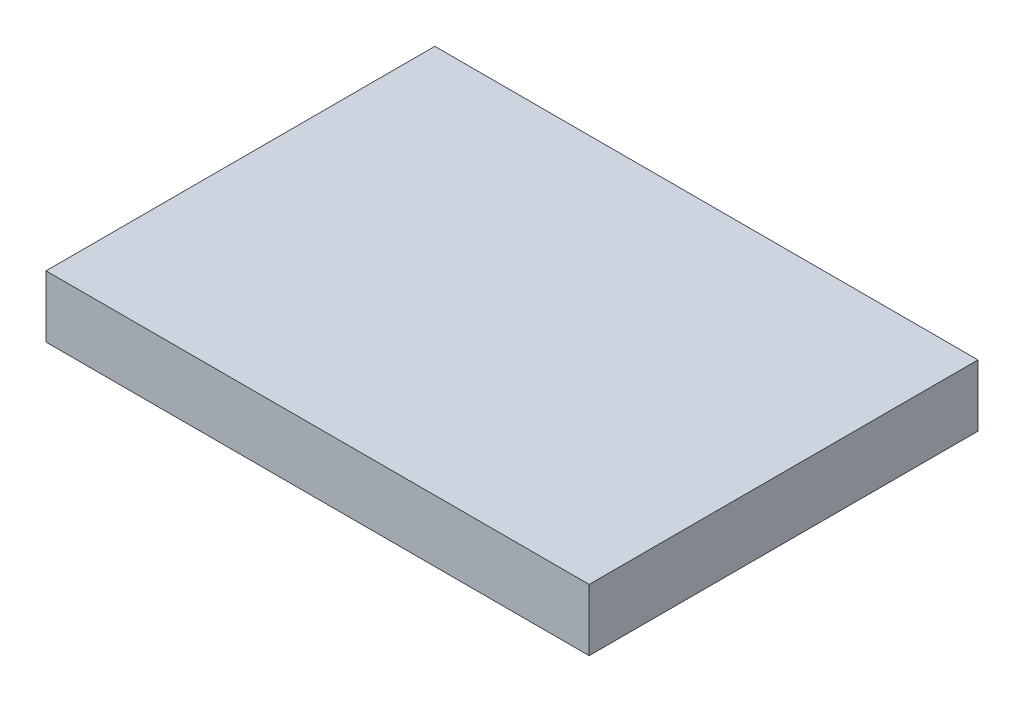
from build123d import *

# Parameters (mm, degrees)
SKETCH_1_W      = 88
SKETCH_1_H      = 63
EXTRUDE_1_DEPTH = 10


with BuildPart() as part:
    # Sketch 1 → Extrude 1 (new body)
    with BuildSketch(Plane(origin=(0, 0, 0), x_dir=(1, 0, 0), z_dir=(0, 1, 0))):
        Rectangle(SKETCH_1_W, SKETCH_1_H)
    extrude(amount=EXTRUDE_1_DEPTH)


solid = part.part
